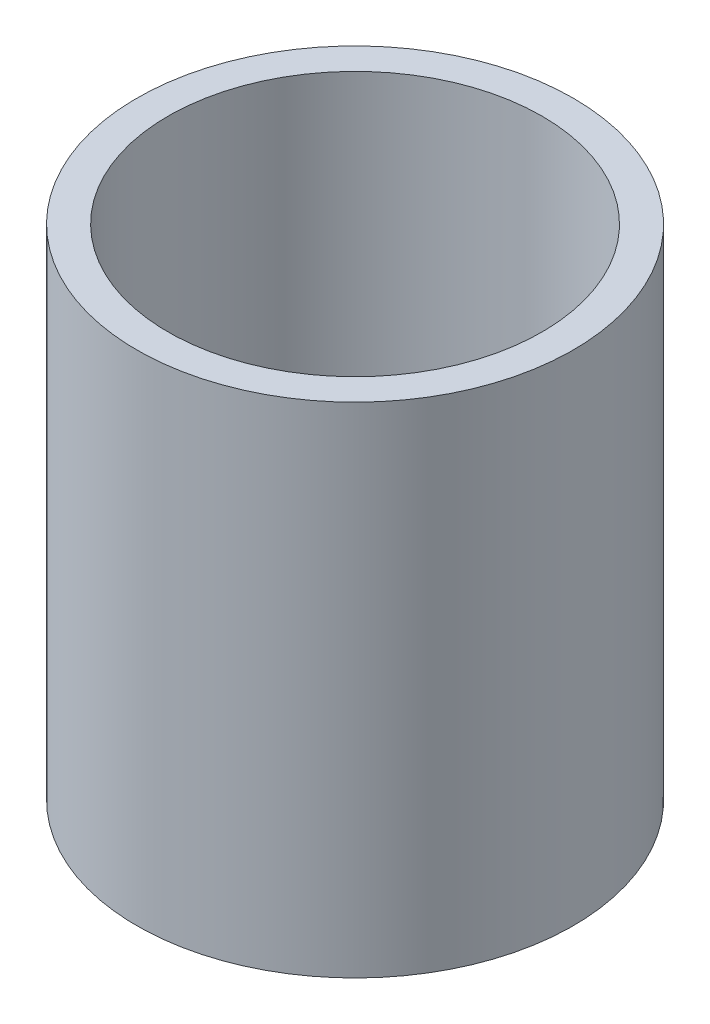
ISO-10303-21;
HEADER;
FILE_DESCRIPTION(('STEP AP214'),'2;1');
FILE_NAME('part.step','',(''),(''),'','','');
FILE_SCHEMA(('AUTOMOTIVE_DESIGN { 1 0 10303 214 1 1 1 1 }'));
ENDSEC;
DATA;
#1=APPLICATION_CONTEXT('core data for automotive mechanical design processes');
#2=APPLICATION_PROTOCOL_DEFINITION('international standard','automotive_design',2000,#1);
#3=PRODUCT_CONTEXT('',#1,'mechanical');
#4=PRODUCT('Part','Part','',(#3));
#5=PRODUCT_RELATED_PRODUCT_CATEGORY('part','',(#4));
#6=PRODUCT_DEFINITION_FORMATION('','',#4);
#7=PRODUCT_DEFINITION_CONTEXT('part definition',#1,'design');
#8=PRODUCT_DEFINITION('design','',#6,#7);
#9=PRODUCT_DEFINITION_SHAPE('','',#8);
#10=(LENGTH_UNIT() NAMED_UNIT(*) SI_UNIT(.MILLI.,.METRE.));
#11=(NAMED_UNIT(*) PLANE_ANGLE_UNIT() SI_UNIT($,.RADIAN.));
#12=(NAMED_UNIT(*) SI_UNIT($,.STERADIAN.) SOLID_ANGLE_UNIT());
#13=UNCERTAINTY_MEASURE_WITH_UNIT(LENGTH_MEASURE(1.E-05),#10,'distance_accuracy_value','');
#14=(GEOMETRIC_REPRESENTATION_CONTEXT(3) GLOBAL_UNCERTAINTY_ASSIGNED_CONTEXT((#13)) GLOBAL_UNIT_ASSIGNED_CONTEXT((#10,
#11,#12)) REPRESENTATION_CONTEXT('',''));
#15=CARTESIAN_POINT('',(0.,0.,0.));
#16=DIRECTION('',(0.,0.,1.));
#17=DIRECTION('',(1.,0.,0.));
#18=AXIS2_PLACEMENT_3D('',#15,#16,#17);
#19=CARTESIAN_POINT('',(0.,0.,0.));
#20=DIRECTION('',(0.,-1.,0.));
#21=DIRECTION('',(0.,0.,-1.));
#22=AXIS2_PLACEMENT_3D('',#19,#20,#21);
#23=CYLINDRICAL_SURFACE('',#22,4.7625);
#24=CARTESIAN_POINT('',(0.,12.7,0.));
#25=DIRECTION('',(0.,-1.,0.));
#26=DIRECTION('',(0.,0.,-1.));
#27=AXIS2_PLACEMENT_3D('',#24,#25,#26);
#28=CIRCLE('',#27,4.7625);
#29=CARTESIAN_POINT('',(0.,12.7,-4.7625));
#30=VERTEX_POINT('',#29);
#31=EDGE_CURVE('E10',#30,#30,#28,.T.);
#32=ORIENTED_EDGE('',*,*,#31,.F.);
#33=EDGE_LOOP('',(#32));
#34=FACE_BOUND('',#33,.T.);
#35=CARTESIAN_POINT('',(0.,0.,0.));
#36=DIRECTION('',(0.,-1.,0.));
#37=DIRECTION('',(0.,0.,-1.));
#38=AXIS2_PLACEMENT_3D('',#35,#36,#37);
#39=CIRCLE('',#38,4.7625);
#40=CARTESIAN_POINT('',(0.,0.,-4.7625));
#41=VERTEX_POINT('',#40);
#42=EDGE_CURVE('E45',#41,#41,#39,.T.);
#43=ORIENTED_EDGE('',*,*,#42,.T.);
#44=EDGE_LOOP('',(#43));
#45=FACE_BOUND('',#44,.T.);
#46=ADVANCED_FACE('F31',(#34,#45),#23,.F.);
#47=CARTESIAN_POINT('',(-4.7625,12.7,0.));
#48=DIRECTION('',(0.,-1.,0.));
#49=DIRECTION('',(0.,0.,-1.));
#50=AXIS2_PLACEMENT_3D('',#47,#48,#49);
#51=PLANE('',#50);
#52=CARTESIAN_POINT('',(0.,12.7,0.));
#53=DIRECTION('',(0.,-1.,0.));
#54=DIRECTION('',(0.,0.,-1.));
#55=AXIS2_PLACEMENT_3D('',#52,#53,#54);
#56=CIRCLE('',#55,5.55625);
#57=CARTESIAN_POINT('',(0.,12.7,-5.55625));
#58=VERTEX_POINT('',#57);
#59=EDGE_CURVE('E37',#58,#58,#56,.T.);
#60=ORIENTED_EDGE('',*,*,#59,.F.);
#61=EDGE_LOOP('',(#60));
#62=FACE_BOUND('',#61,.T.);
#63=ORIENTED_EDGE('',*,*,#31,.T.);
#64=EDGE_LOOP('',(#63));
#65=FACE_BOUND('',#64,.T.);
#66=ADVANCED_FACE('F60',(#62,#65),#51,.F.);
#67=CARTESIAN_POINT('',(0.,0.,0.));
#68=DIRECTION('',(0.,-1.,0.));
#69=DIRECTION('',(0.,0.,-1.));
#70=AXIS2_PLACEMENT_3D('',#67,#68,#69);
#71=CYLINDRICAL_SURFACE('',#70,5.55625);
#72=CARTESIAN_POINT('',(0.,0.,0.));
#73=DIRECTION('',(0.,-1.,0.));
#74=DIRECTION('',(0.,0.,-1.));
#75=AXIS2_PLACEMENT_3D('',#72,#73,#74);
#76=CIRCLE('',#75,5.55625);
#77=CARTESIAN_POINT('',(0.,0.,-5.55625));
#78=VERTEX_POINT('',#77);
#79=EDGE_CURVE('E41',#78,#78,#76,.T.);
#80=ORIENTED_EDGE('',*,*,#79,.F.);
#81=EDGE_LOOP('',(#80));
#82=FACE_BOUND('',#81,.T.);
#83=ORIENTED_EDGE('',*,*,#59,.T.);
#84=EDGE_LOOP('',(#83));
#85=FACE_BOUND('',#84,.T.);
#86=ADVANCED_FACE('F55',(#82,#85),#71,.T.);
#87=CARTESIAN_POINT('',(-4.7625,0.,0.));
#88=DIRECTION('',(0.,1.,0.));
#89=DIRECTION('',(0.,0.,1.));
#90=AXIS2_PLACEMENT_3D('',#87,#88,#89);
#91=PLANE('',#90);
#92=ORIENTED_EDGE('',*,*,#42,.F.);
#93=EDGE_LOOP('',(#92));
#94=FACE_BOUND('',#93,.T.);
#95=ORIENTED_EDGE('',*,*,#79,.T.);
#96=EDGE_LOOP('',(#95));
#97=FACE_BOUND('',#96,.T.);
#98=ADVANCED_FACE('F52',(#94,#97),#91,.F.);
#99=CLOSED_SHELL('',(#46,#66,#86,#98));
#100=MANIFOLD_SOLID_BREP('B2',#99);
#101=ADVANCED_BREP_SHAPE_REPRESENTATION('',(#18,#100),#14);
#102=SHAPE_DEFINITION_REPRESENTATION(#9,#101);
ENDSEC;
END-ISO-10303-21;
